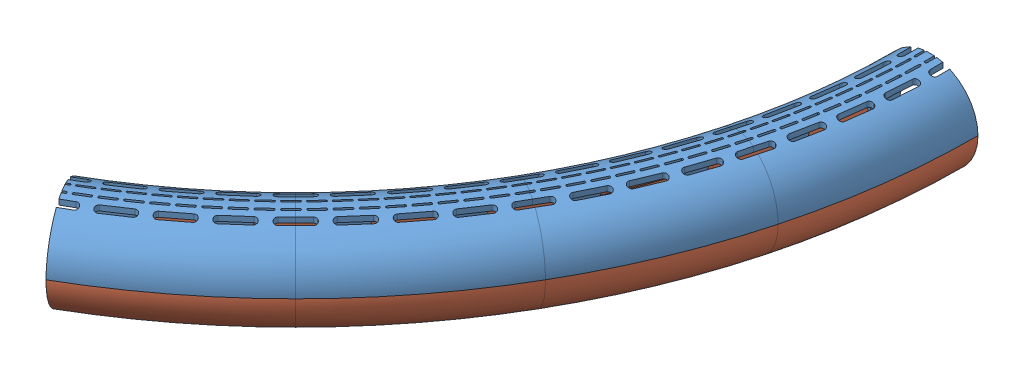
SolidWorks assembly Сборка8.sldasm, configuration По умолчанию (file format 12000). Lengths in mm.
Overall size (133.54 30 203.25).
18 component instances, 3 part files, 2 mates.
Components (placement in the parent):
- big_30-1: big_30.SLDASM [По умолчанию] at (60.1652 35.0052 -18.5955) size (57.11 30 110.57)
  - big_15-1: big_15.SLDASM [По умолчанию] at (11.0708 3.2405 -12.0861) size (36.3 30 56.86)
    - big_frame-1: big_frame.SLDPRT [По умолчанию] at (-161.077 38.0168 -5.962) size (36.3 25.55 56.86)
    - big_glass-1: big_glass.SLDPRT [По умолчанию] at (-161.077 38.0168 -5.962) size (36.3 15.78 55.65)
    - big_led-1: big_led.SLDPRT [По умолчанию] at (-161.077 38.0168 -5.962) size (15.37 10 52.89)
  - big_15-2: big_15.SLDASM [По умолчанию] at (4.0391 3.2405 29.4006) x (0.965926 0 0.258819) z (-0.258819 0 0.965926) size (36.3 30 56.86)
    - big_frame-1: big_frame.SLDPRT [По умолчанию] at (-161.077 38.0168 -5.962) size (36.3 25.55 56.86)
    - big_glass-1: big_glass.SLDPRT [По умолчанию] at (-161.077 38.0168 -5.962) size (36.3 15.78 55.65)
    - big_led-1: big_led.SLDPRT [По умолчанию] at (-161.077 38.0168 -5.962) size (15.37 10 52.89)
- big_30-2: big_30.SLDASM [По умолчанию] at (31.0441 35.0052 53.9896) x (0.866025 0 0.5) z (-0.5 0 0.866025) size (57.11 30 110.57)
  - big_15-1: big_15.SLDASM [По умолчанию] at (11.0708 3.2405 -12.0861) size (36.3 30 56.86)
    - big_frame-1: big_frame.SLDPRT [По умолчанию] at (-161.077 38.0168 -5.962) size (36.3 25.55 56.86)
    - big_glass-1: big_glass.SLDPRT [По умолчанию] at (-161.077 38.0168 -5.962) size (36.3 15.78 55.65)
    - big_led-1: big_led.SLDPRT [По умолчанию] at (-161.077 38.0168 -5.962) size (15.37 10 52.89)
  - big_15-2: big_15.SLDASM [По умолчанию] at (4.0391 3.2405 29.4006) x (0.965926 0 0.258819) z (-0.258819 0 0.965926) size (36.3 30 56.86)
    - big_frame-1: big_frame.SLDPRT [По умолчанию] at (-161.077 38.0168 -5.962) size (36.3 25.55 56.86)
    - big_glass-1: big_glass.SLDPRT [По умолчанию] at (-161.077 38.0168 -5.962) size (36.3 15.78 55.65)
    - big_led-1: big_led.SLDPRT [По умолчанию] at (-161.077 38.0168 -5.962) size (15.37 10 52.89)
Mates (geometry in assembly coordinates):
- Совпадение1: coincident: circle of big_30-1/big_15-2/big_frame-1; circle of big_30-2/big_15-1/big_frame-1
- Совпадение2: coincident: point of big_30-1/big_15-2/big_frame-1; point of big_30-2/big_15-1/big_frame-1
